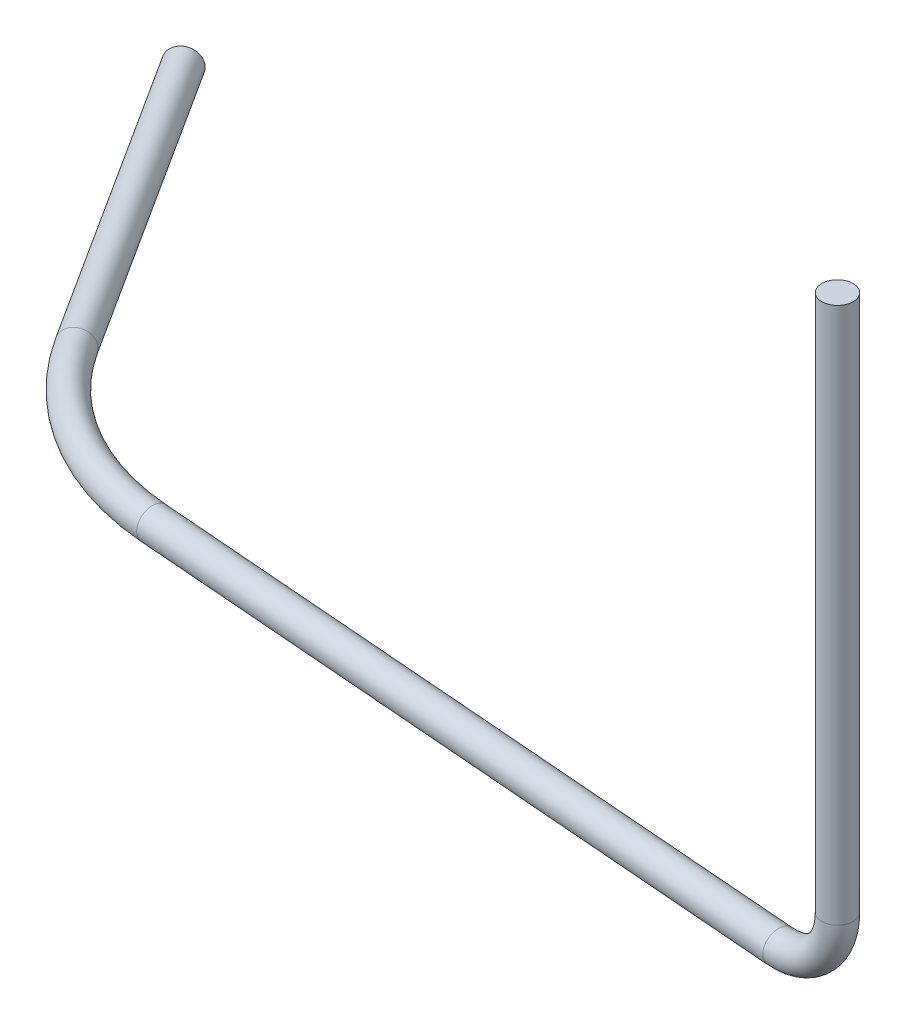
from build123d import *

# Parameters (mm, degrees)
ESQUISSE1_R = 0.25


with BuildPart() as part:
    # Balayage1: sweep along a curve in space
    with BuildLine() as balayage1_path:
        Line((3.964223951, 6, 8.435347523), (3.964223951, -2.54, 8.435347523))
        ThreePointArc((3.964223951, -2.54, 8.435347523), (3.67222458, -3.247106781, 8.412482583), (2.967275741, -3.54, 8.357281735))
        Line((2.967275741, -3.54, 8.357281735), (-7.840923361, -3.54, 7.510948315))
        ThreePointArc((-7.840923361, -3.54, 7.510948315), (-9.584503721, -3.54, 6.954409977), (-10.897666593, -3.54, 5.679494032))
        Line((-10.897666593, -3.54, 5.679494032), (-13.922936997, -3.54, 0.952891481))
    # Esquisse1 → Balayage1 (sweep)
    with BuildSketch(Plane(origin=(3.964223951, 6, 8.435347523), x_dir=(1, 0, 0), z_dir=(0, -1, 0))):
        Circle(ESQUISSE1_R)
    sweep(path=balayage1_path.line)


solid = part.part
